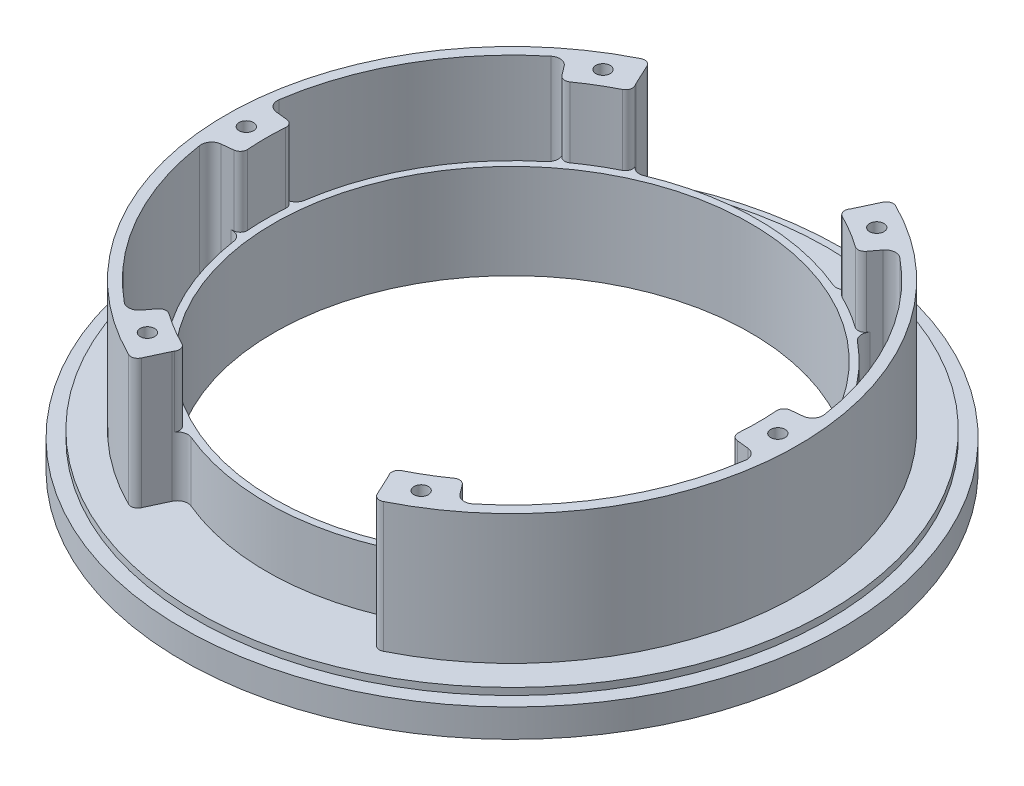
from build123d import *

# Parameters (mm, degrees)
SKETCH_1_R           = 35
SKETCH_1_R_2         = 34
EXTRUDE_1_DEPTH      = 23.5
SKETCH_2_R           = 45
SKETCH_2_R_2         = 35
EXTRUDE_2_DEPTH      = 5
SKETCH_4_R           = 40.8
SKETCH_4_R_2         = 35
EXTRUDE_3_DEPTH      = 18.5
CUT_EXTRUDE_START    = -18.5
CUT_EXTRUDE_1_DEPTH  = 18.5
SKETCH_6_R           = 47
SKETCH_6_R_2         = 45
EXTRUDE_4_DEPTH      = 4
SKETCH_8_R           = 1.5
SKETCH_8_R_2         = 1
CUT_EXTRUDE_3_DEPTH  = 71.5
CUT_EXTRUDE_START_2  = -10
SKETCH_9_R           = 35
CUT_EXTRUDE_4_DEPTH  = 10
HOLE_WIZARD_M2_5_1_D = 2.05
CUT_EXTRUDE_5_REACH  = 72.5
FILLET_1_R           = 1.5
SKETCH_14_R          = 35.1
CUT_EXTRUDE_6_DEPTH  = 10
FILLET_2_R           = 1
FILLET_5_R           = 1.5
FILLET_6_R           = 1
FILLET_7_R           = 1
FILLET_8_R           = 1
FILLET_9_R           = 1


with BuildPart() as part:
    # Sketch 1 → Extrude 1 (new body)
    with BuildSketch(Plane(origin=(0, 0, 0), x_dir=(1, 0, 0), z_dir=(0, 1, 0))):
        with Locations(Location((0, 0, 0), (0, 0, 270))):
            Circle(SKETCH_1_R)
        with Locations(Location((0, 0, 0), (0, 0, 270))):
            Circle(SKETCH_1_R_2, mode=Mode.SUBTRACT)
    extrude(amount=EXTRUDE_1_DEPTH)

    # Sketch 2 → Extrude 2 (add)
    with BuildSketch(Plane.XZ):
        with Locations(Location((0, 0, 0), (0, 0, 270))):
            Circle(SKETCH_2_R)
        with Locations(Location((0, 0, 0), (0, 0, 270))):
            Circle(SKETCH_2_R_2, mode=Mode.SUBTRACT)
    extrude(amount=-EXTRUDE_2_DEPTH)

    # Sketch 4 → Extrude 3 (add)
    with BuildSketch(Plane(origin=(0, 5, 0), x_dir=(1, 0, 0), z_dir=(0, 1, 0))):
        with Locations(Location((0, 0, 0), (0, 0, 90))):
            Circle(SKETCH_4_R)
        Circle(SKETCH_4_R_2, mode=Mode.SUBTRACT)
    extrude(amount=EXTRUDE_3_DEPTH)

    # Sketch 5 → Cut-Extrude 1 (cut)
    with BuildSketch(Plane(origin=(0, 23.5, 0), x_dir=(1, 0, 0), z_dir=(0, 1, 0)).offset(CUT_EXTRUDE_START)):
        with BuildLine():
            Line((-17.242825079, 36.977357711), (-14.791639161, 31.720772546))
            ThreePointArc((-14.791639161, 31.720772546), (0, 35), (14.791639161, 31.720772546))
            Line((14.791639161, 31.720772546), (17.242825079, 36.977357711))
            ThreePointArc((17.242825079, 36.977357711), (0, 40.8), (-17.242825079, 36.977357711))
        make_face()
        with BuildLine():
            Line((17.242825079, -36.977357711), (14.791639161, -31.720772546))
            ThreePointArc((14.791639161, -31.720772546), (0, -35), (-14.791639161, -31.720772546))
            Line((-14.791639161, -31.720772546), (-17.242825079, -36.977357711))
            ThreePointArc((-17.242825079, -36.977357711), (0, -40.8), (17.242825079, -36.977357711))
        make_face()
    extrude(amount=CUT_EXTRUDE_1_DEPTH, mode=Mode.SUBTRACT)

    # Sketch 6 → Extrude 4 (add)
    with BuildSketch(Plane.XZ):
        with Locations(Location((0, 0, 0), (0, 0, 270))):
            Circle(SKETCH_6_R)
        with Locations(Location((0, 0, 0), (0, 0, 270))):
            Circle(SKETCH_6_R_2, mode=Mode.SUBTRACT)
    extrude(amount=-EXTRUDE_4_DEPTH)

    # Sketch 8 → Cut-Extrude 3 (cut, through all)
    with BuildSketch(Plane.XZ):
        with Locations(Location((-10.08130992, -37.623960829, 0), (0, 0, 270))):
            Circle(SKETCH_8_R)
        with Locations(Location((-5.757352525, -38.523345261, 0), (0, 0, 270))):
            Circle(SKETCH_8_R)
        with Locations(Location((-2.391427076, -39.099487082, 0), (0, 0, 270))):
            Circle(SKETCH_8_R_2)
        with Locations(Location((0.341840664, -39.171060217, 0), (0, 0, 270))):
            Circle(SKETCH_8_R_2)
        with Locations(Location((3.073442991, -39.051795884, 0), (0, 0, 270))):
            Circle(SKETCH_8_R_2)
        with Locations(Location((5.790071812, -38.742275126, 0), (0, 0, 270))):
            Circle(SKETCH_8_R_2)
        with Locations(Location((8.478491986, -38.244005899, 0), (0, 0, 270))):
            Circle(SKETCH_8_R_2)
        with Locations(Location((7.937392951, -35.803265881, 0), (0, 0, 270))):
            Circle(SKETCH_8_R_2)
        with Locations(Location((5.420548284, -36.269735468, 0), (0, 0, 270))):
            Circle(SKETCH_8_R_2)
        with Locations(Location((2.877295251, -36.559502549, 0), (0, 0, 270))):
            Circle(SKETCH_8_R_2)
        with Locations(Location((0.320024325, -36.671155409, 0), (0, 0, 270))):
            Circle(SKETCH_8_R_2)
        with Locations(Location((-2.238805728, -36.604150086, 0), (0, 0, 270))):
            Circle(SKETCH_8_R_2)
    extrude(amount=-CUT_EXTRUDE_3_DEPTH, mode=Mode.SUBTRACT)

    # Sketch 9 → Cut-Extrude 4 (cut)
    with BuildSketch(Plane(origin=(0, 23.5, 0), x_dir=(1, 0, 0), z_dir=(0, 1, 0)).offset(CUT_EXTRUDE_START_2)):
        Circle(SKETCH_9_R)
    extrude(amount=CUT_EXTRUDE_4_DEPTH, mode=Mode.SUBTRACT)

    # Hole Wizard M2.5 _1 (through all)
    with Locations(Plane(origin=(-19.519943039, 23.5, -32.486640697), x_dir=(0, 0, 1), z_dir=(0, 1, 0))):
        with Locations((0, 0), (32.486640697, -18.380056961), (0, 39.039886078), (32.486640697, 57.419943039), (64.973281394, 39.039886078), (64.973281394, 0)):
            Hole(HOLE_WIZARD_M2_5_1_D / 2)

    # Cut-Extrude 5: up to this face of the body (flat: up to its plane)
    cut_extrude_5_end = Plane(part.part.faces().sort_by_distance((0, 4, 45.670639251))[0])
    # Sketch 13 → Cut-Extrude 5 (cut, up to the picked face)
    with BuildSketch(Plane(origin=(0, 23.5, 0), x_dir=(1, 0, 0), z_dir=(0, 1, 0)), mode=Mode.PRIVATE) as cut_extrude_5_sk1:
        with BuildLine():
            Line((-21.06352581, 27.952242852), (-23.65133041, 31.386375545))
            ThreePointArc((-23.65133041, 31.386375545), (-34.20497885, 19.352245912), (-39.084710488, 4.107968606))
            Line((-39.084710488, 4.107968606), (-34.808266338, 3.658496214))
            ThreePointArc((-34.808266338, 3.658496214), (-30.462449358, 17.234824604), (-21.06352581, 27.952242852))
        make_face()
    cut_extrude_5_tool1 = split(extrude(cut_extrude_5_sk1.sketch, amount=-CUT_EXTRUDE_5_REACH, mode=Mode.PRIVATE), bisect_by=cut_extrude_5_end, keep=Keep.BOTH, mode=Mode.PRIVATE)
    # Sketch 13 → Cut-Extrude 5 (cut, up to the picked face)
    with BuildSketch(Plane(origin=(0, 23.5, 0), x_dir=(1, 0, 0), z_dir=(0, 1, 0)), mode=Mode.PRIVATE) as cut_extrude_5_sk2:
        with BuildLine():
            Line((-34.808266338, -3.658496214), (-39.084710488, -4.107968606))
            ThreePointArc((-39.084710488, -4.107968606), (-34.20497885, -19.352245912), (-23.65133041, -31.386375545))
            Line((-23.65133041, -31.386375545), (-21.06352581, -27.952242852))
            ThreePointArc((-21.06352581, -27.952242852), (-30.462449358, -17.234824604), (-34.808266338, -3.658496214))
        make_face()
    cut_extrude_5_tool2 = split(extrude(cut_extrude_5_sk2.sketch, amount=-CUT_EXTRUDE_5_REACH, mode=Mode.PRIVATE), bisect_by=cut_extrude_5_end, keep=Keep.BOTH, mode=Mode.PRIVATE)
    # Sketch 13 → Cut-Extrude 5 (cut, up to the picked face)
    with BuildSketch(Plane(origin=(0, 23.5, 0), x_dir=(1, 0, 0), z_dir=(0, 1, 0)), mode=Mode.PRIVATE) as cut_extrude_5_sk3:
        with BuildLine():
            ThreePointArc((34.808266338, -3.658496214), (30.462449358, -17.234824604), (21.06352581, -27.952242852))
            Line((21.06352581, -27.952242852), (23.65133041, -31.386375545))
            ThreePointArc((23.65133041, -31.386375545), (34.20497885, -19.352245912), (39.084710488, -4.107968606))
            Line((39.084710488, -4.107968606), (34.808266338, -3.658496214))
        make_face()
    cut_extrude_5_tool3 = split(extrude(cut_extrude_5_sk3.sketch, amount=-CUT_EXTRUDE_5_REACH, mode=Mode.PRIVATE), bisect_by=cut_extrude_5_end, keep=Keep.BOTH, mode=Mode.PRIVATE)
    # Sketch 13 → Cut-Extrude 5 (cut, up to the picked face)
    with BuildSketch(Plane(origin=(0, 23.5, 0), x_dir=(1, 0, 0), z_dir=(0, 1, 0)), mode=Mode.PRIVATE) as cut_extrude_5_sk4:
        with BuildLine():
            ThreePointArc((39.084710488, 4.107968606), (34.20497885, 19.352245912), (23.65133041, 31.386375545))
            Line((23.65133041, 31.386375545), (21.06352581, 27.952242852))
            ThreePointArc((21.06352581, 27.952242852), (30.462449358, 17.234824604), (34.808266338, 3.658496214))
            Line((34.808266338, 3.658496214), (39.084710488, 4.107968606))
        make_face()
    cut_extrude_5_tool4 = split(extrude(cut_extrude_5_sk4.sketch, amount=-CUT_EXTRUDE_5_REACH, mode=Mode.PRIVATE), bisect_by=cut_extrude_5_end, keep=Keep.BOTH, mode=Mode.PRIVATE)
    add(cut_extrude_5_tool1.solids().sort_by(Axis((-31.469848, 23.5, -17.804783), (0, -1, 0)))[0], mode=Mode.SUBTRACT)
    add(cut_extrude_5_tool2.solids().sort_by(Axis((-31.469848, 23.5, 17.804783), (0, -1, 0)))[0], mode=Mode.SUBTRACT)
    add(cut_extrude_5_tool3.solids().sort_by(Axis((31.469848, 23.5, 17.804783), (0, -1, 0)))[0], mode=Mode.SUBTRACT)
    add(cut_extrude_5_tool4.solids().sort_by(Axis((31.469848, 23.5, -17.804783), (0, -1, 0)))[0], mode=Mode.SUBTRACT)

    # Fillet 1
    fillet_1_edges = [part.edges().sort_by_distance(p)[0] for p in [
        (39.084710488, 13.75, -4.107968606),
        (23.65133041, 13.75, -31.386375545),
        (21.06352581, 8.75, -27.952242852),
        (34.808266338, 8.75, -3.658496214),
        (21.06352581, 8.75, 27.952242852),
        (34.808266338, 8.75, 3.658496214),
        (39.084710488, 13.75, 4.107968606),
        (23.65133041, 13.75, 31.386375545),
        (-23.65133041, 13.75, 31.386375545),
        (-21.06352581, 8.75, 27.952242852),
        (-34.808266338, 8.75, 3.658496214),
        (-39.084710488, 13.75, 4.107968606),
        (-39.084710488, 13.75, -4.107968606),
        (-34.808266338, 8.75, -3.658496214),
        (-21.06352581, 8.75, -27.952242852),
        (-23.65133041, 13.75, -31.386375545),
    ]]
    fillet(fillet_1_edges, radius=FILLET_1_R)

    # Sketch 14 → Cut-Extrude 6 (cut)
    with BuildSketch(Plane(origin=(0, 23.5, 0), x_dir=(1, 0, 0), z_dir=(0, 1, 0))):
        Circle(SKETCH_14_R)
    extrude(amount=-CUT_EXTRUDE_6_DEPTH, mode=Mode.SUBTRACT)

    # Fillet 2
    fillet_2_edges = [part.edges().sort_by_distance(p)[0] for p in [
        (17.242825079, 14.25, -36.977357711),
        (-17.242825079, 14.25, -36.977357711),
        (-17.242825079, 14.25, 36.977357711),
        (17.242825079, 14.25, 36.977357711),
    ]]
    fillet(fillet_2_edges, radius=FILLET_2_R)

    # Fillet 5
    fillet_5_edges = [part.edges().sort_by_distance(p)[0] for p in [
        (-14.791639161, 9.25, 31.720772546),
        (14.791639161, 9.25, 31.720772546),
        (-14.791639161, 9.25, -31.720772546),
        (14.791639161, 9.25, -31.720772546),
    ]]
    fillet(fillet_5_edges, radius=FILLET_5_R)

    # Fillet 6
    fillet_6_edges = [part.edges().sort_by_distance(p)[0] for p in [
        (21.123707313, 18.4999997, -28.032106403),
        (34.907718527, 18.4999997, 3.668949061),
        (21.123707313, 18.4999997, 28.032106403),
        (34.907718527, 18.4999997, -3.668949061),
        (-13.999885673, 18.5, 32.187158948),
        (13.999885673, 18.5, 32.187158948),
        (13.999885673, 18.5, -32.187158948),
    ]]
    fillet(fillet_6_edges, radius=FILLET_6_R)

    # Fillet 7
    fillet_7_edges = [part.edges().sort_by_distance(p)[0] for p in [
        (-13.999885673, 18.5, -32.187158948),
    ]]
    fillet(fillet_7_edges, radius=FILLET_7_R)

    # Fillet 8
    fillet_8_edges = [part.edges().sort_by_distance(p)[0] for p in [
        (-21.123707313, 18.4999997, 28.032106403),
        (-34.907718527, 18.4999997, -3.668949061),
        (-34.907718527, 18.4999997, 3.668949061),
    ]]
    fillet(fillet_8_edges, radius=FILLET_8_R)

    # Fillet 9
    fillet_9_edges = [part.edges().sort_by_distance(p)[0] for p in [
        (-21.123707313, 18.4999997, -28.032106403),
    ]]
    fillet(fillet_9_edges, radius=FILLET_9_R)


solid = part.part
